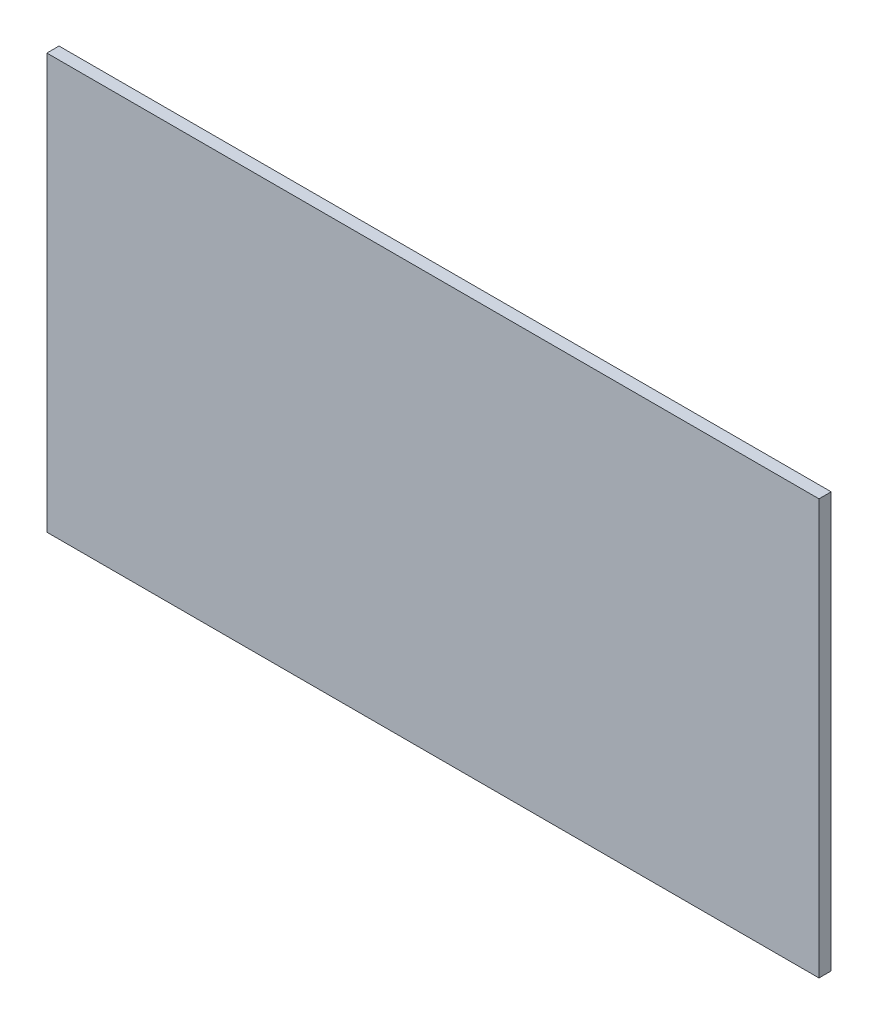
ISO-10303-21;
HEADER;
FILE_DESCRIPTION(('STEP AP214'),'2;1');
FILE_NAME('part.step','',(''),(''),'','','');
FILE_SCHEMA(('AUTOMOTIVE_DESIGN { 1 0 10303 214 1 1 1 1 }'));
ENDSEC;
DATA;
#1=APPLICATION_CONTEXT('core data for automotive mechanical design processes');
#2=APPLICATION_PROTOCOL_DEFINITION('international standard','automotive_design',2000,#1);
#3=PRODUCT_CONTEXT('',#1,'mechanical');
#4=PRODUCT('Part','Part','',(#3));
#5=PRODUCT_RELATED_PRODUCT_CATEGORY('part','',(#4));
#6=PRODUCT_DEFINITION_FORMATION('','',#4);
#7=PRODUCT_DEFINITION_CONTEXT('part definition',#1,'design');
#8=PRODUCT_DEFINITION('design','',#6,#7);
#9=PRODUCT_DEFINITION_SHAPE('','',#8);
#10=(LENGTH_UNIT() NAMED_UNIT(*) SI_UNIT(.MILLI.,.METRE.));
#11=(NAMED_UNIT(*) PLANE_ANGLE_UNIT() SI_UNIT($,.RADIAN.));
#12=(NAMED_UNIT(*) SI_UNIT($,.STERADIAN.) SOLID_ANGLE_UNIT());
#13=UNCERTAINTY_MEASURE_WITH_UNIT(LENGTH_MEASURE(1.E-05),#10,'distance_accuracy_value','');
#14=(GEOMETRIC_REPRESENTATION_CONTEXT(3) GLOBAL_UNCERTAINTY_ASSIGNED_CONTEXT((#13)) GLOBAL_UNIT_ASSIGNED_CONTEXT((#10,
#11,#12)) REPRESENTATION_CONTEXT('',''));
#15=CARTESIAN_POINT('',(0.,0.,0.));
#16=DIRECTION('',(0.,0.,1.));
#17=DIRECTION('',(1.,0.,0.));
#18=AXIS2_PLACEMENT_3D('',#15,#16,#17);
#19=CARTESIAN_POINT('',(0.,0.,0.2));
#20=DIRECTION('',(1.,0.,0.));
#21=DIRECTION('',(0.,0.,-1.));
#22=AXIS2_PLACEMENT_3D('',#19,#20,#21);
#23=PLANE('',#22);
#24=DIRECTION('',(0.,-1.,0.));
#25=VECTOR('',#24,1.);
#26=CARTESIAN_POINT('',(0.,0.,0.));
#27=LINE('',#26,#25);
#28=CARTESIAN_POINT('',(0.,6.82093281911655,0.));
#29=VERTEX_POINT('',#28);
#30=CARTESIAN_POINT('',(0.,0.,0.));
#31=VERTEX_POINT('',#30);
#32=EDGE_CURVE('E97',#29,#31,#27,.T.);
#33=ORIENTED_EDGE('',*,*,#32,.T.);
#34=DIRECTION('',(0.,0.,-1.));
#35=VECTOR('',#34,1.);
#36=CARTESIAN_POINT('',(0.,0.,0.2));
#37=LINE('',#36,#35);
#38=CARTESIAN_POINT('',(0.,0.,0.2));
#39=VERTEX_POINT('',#38);
#40=EDGE_CURVE('E11',#39,#31,#37,.T.);
#41=ORIENTED_EDGE('',*,*,#40,.F.);
#42=DIRECTION('',(0.,-1.,0.));
#43=VECTOR('',#42,1.);
#44=CARTESIAN_POINT('',(0.,0.,0.2));
#45=LINE('',#44,#43);
#46=CARTESIAN_POINT('',(0.,6.82093281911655,0.2));
#47=VERTEX_POINT('',#46);
#48=EDGE_CURVE('E85',#47,#39,#45,.T.);
#49=ORIENTED_EDGE('',*,*,#48,.F.);
#50=DIRECTION('',(0.,0.,-1.));
#51=VECTOR('',#50,1.);
#52=CARTESIAN_POINT('',(0.,6.82093281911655,0.2));
#53=LINE('',#52,#51);
#54=EDGE_CURVE('E93',#47,#29,#53,.T.);
#55=ORIENTED_EDGE('',*,*,#54,.T.);
#56=EDGE_LOOP('',(#33,#41,#49,#55));
#57=FACE_BOUND('',#56,.T.);
#58=ADVANCED_FACE('F34',(#57),#23,.F.);
#59=CARTESIAN_POINT('',(0.,0.,0.2));
#60=DIRECTION('',(0.,1.,0.));
#61=DIRECTION('',(0.,0.,1.));
#62=AXIS2_PLACEMENT_3D('',#59,#60,#61);
#63=PLANE('',#62);
#64=DIRECTION('',(1.,0.,0.));
#65=VECTOR('',#64,1.);
#66=CARTESIAN_POINT('',(0.,0.,0.));
#67=LINE('',#66,#65);
#68=CARTESIAN_POINT('',(12.691062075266,0.,0.));
#69=VERTEX_POINT('',#68);
#70=EDGE_CURVE('E89',#31,#69,#67,.T.);
#71=ORIENTED_EDGE('',*,*,#70,.T.);
#72=DIRECTION('',(0.,0.,-1.));
#73=VECTOR('',#72,1.);
#74=CARTESIAN_POINT('',(12.691062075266,0.,0.2));
#75=LINE('',#74,#73);
#76=CARTESIAN_POINT('',(12.691062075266,0.,0.2));
#77=VERTEX_POINT('',#76);
#78=EDGE_CURVE('E42',#77,#69,#75,.T.);
#79=ORIENTED_EDGE('',*,*,#78,.F.);
#80=DIRECTION('',(1.,0.,0.));
#81=VECTOR('',#80,1.);
#82=CARTESIAN_POINT('',(0.,0.,0.2));
#83=LINE('',#82,#81);
#84=EDGE_CURVE('E80',#39,#77,#83,.T.);
#85=ORIENTED_EDGE('',*,*,#84,.F.);
#86=ORIENTED_EDGE('',*,*,#40,.T.);
#87=EDGE_LOOP('',(#71,#79,#85,#86));
#88=FACE_BOUND('',#87,.T.);
#89=ADVANCED_FACE('F88',(#88),#63,.F.);
#90=CARTESIAN_POINT('',(12.691062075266,0.,0.2));
#91=DIRECTION('',(-1.,0.,0.));
#92=DIRECTION('',(0.,0.,1.));
#93=AXIS2_PLACEMENT_3D('',#90,#91,#92);
#94=PLANE('',#93);
#95=DIRECTION('',(0.,1.,0.));
#96=VECTOR('',#95,1.);
#97=CARTESIAN_POINT('',(12.691062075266,0.,0.));
#98=LINE('',#97,#96);
#99=CARTESIAN_POINT('',(12.691062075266,6.82093281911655,0.));
#100=VERTEX_POINT('',#99);
#101=EDGE_CURVE('E67',#69,#100,#98,.T.);
#102=ORIENTED_EDGE('',*,*,#101,.T.);
#103=DIRECTION('',(0.,0.,-1.));
#104=VECTOR('',#103,1.);
#105=CARTESIAN_POINT('',(12.691062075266,6.82093281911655,0.2));
#106=LINE('',#105,#104);
#107=CARTESIAN_POINT('',(12.691062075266,6.82093281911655,0.2));
#108=VERTEX_POINT('',#107);
#109=EDGE_CURVE('E90',#108,#100,#106,.T.);
#110=ORIENTED_EDGE('',*,*,#109,.F.);
#111=DIRECTION('',(0.,1.,0.));
#112=VECTOR('',#111,1.);
#113=CARTESIAN_POINT('',(12.691062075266,0.,0.2));
#114=LINE('',#113,#112);
#115=EDGE_CURVE('E83',#77,#108,#114,.T.);
#116=ORIENTED_EDGE('',*,*,#115,.F.);
#117=ORIENTED_EDGE('',*,*,#78,.T.);
#118=EDGE_LOOP('',(#102,#110,#116,#117));
#119=FACE_BOUND('',#118,.T.);
#120=ADVANCED_FACE('F91',(#119),#94,.F.);
#121=CARTESIAN_POINT('',(0.,6.82093281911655,0.2));
#122=DIRECTION('',(0.,-1.,0.));
#123=DIRECTION('',(0.,0.,-1.));
#124=AXIS2_PLACEMENT_3D('',#121,#122,#123);
#125=PLANE('',#124);
#126=DIRECTION('',(-1.,0.,0.));
#127=VECTOR('',#126,1.);
#128=CARTESIAN_POINT('',(0.,6.82093281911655,0.));
#129=LINE('',#128,#127);
#130=EDGE_CURVE('E73',#100,#29,#129,.T.);
#131=ORIENTED_EDGE('',*,*,#130,.T.);
#132=ORIENTED_EDGE('',*,*,#54,.F.);
#133=DIRECTION('',(-1.,0.,0.));
#134=VECTOR('',#133,1.);
#135=CARTESIAN_POINT('',(0.,6.82093281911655,0.2));
#136=LINE('',#135,#134);
#137=EDGE_CURVE('E50',#108,#47,#136,.T.);
#138=ORIENTED_EDGE('',*,*,#137,.F.);
#139=ORIENTED_EDGE('',*,*,#109,.T.);
#140=EDGE_LOOP('',(#131,#132,#138,#139));
#141=FACE_BOUND('',#140,.T.);
#142=ADVANCED_FACE('F104',(#141),#125,.F.);
#143=CARTESIAN_POINT('',(0.,6.82093281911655,0.2));
#144=DIRECTION('',(0.,0.,-1.));
#145=DIRECTION('',(-1.,0.,0.));
#146=AXIS2_PLACEMENT_3D('',#143,#144,#145);
#147=PLANE('',#146);
#148=ORIENTED_EDGE('',*,*,#48,.T.);
#149=ORIENTED_EDGE('',*,*,#84,.T.);
#150=ORIENTED_EDGE('',*,*,#115,.T.);
#151=ORIENTED_EDGE('',*,*,#137,.T.);
#152=EDGE_LOOP('',(#148,#149,#150,#151));
#153=FACE_BOUND('',#152,.T.);
#154=ADVANCED_FACE('F81',(#153),#147,.F.);
#155=CARTESIAN_POINT('',(0.,6.82093281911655,0.));
#156=DIRECTION('',(0.,0.,-1.));
#157=DIRECTION('',(-1.,0.,0.));
#158=AXIS2_PLACEMENT_3D('',#155,#156,#157);
#159=PLANE('',#158);
#160=ORIENTED_EDGE('',*,*,#32,.F.);
#161=ORIENTED_EDGE('',*,*,#130,.F.);
#162=ORIENTED_EDGE('',*,*,#101,.F.);
#163=ORIENTED_EDGE('',*,*,#70,.F.);
#164=EDGE_LOOP('',(#160,#161,#162,#163));
#165=FACE_BOUND('',#164,.T.);
#166=ADVANCED_FACE('F107',(#165),#159,.T.);
#167=CLOSED_SHELL('',(#58,#89,#120,#142,#154,#166));
#168=MANIFOLD_SOLID_BREP('B2',#167);
#169=ADVANCED_BREP_SHAPE_REPRESENTATION('',(#18,#168),#14);
#170=SHAPE_DEFINITION_REPRESENTATION(#9,#169);
ENDSEC;
END-ISO-10303-21;
